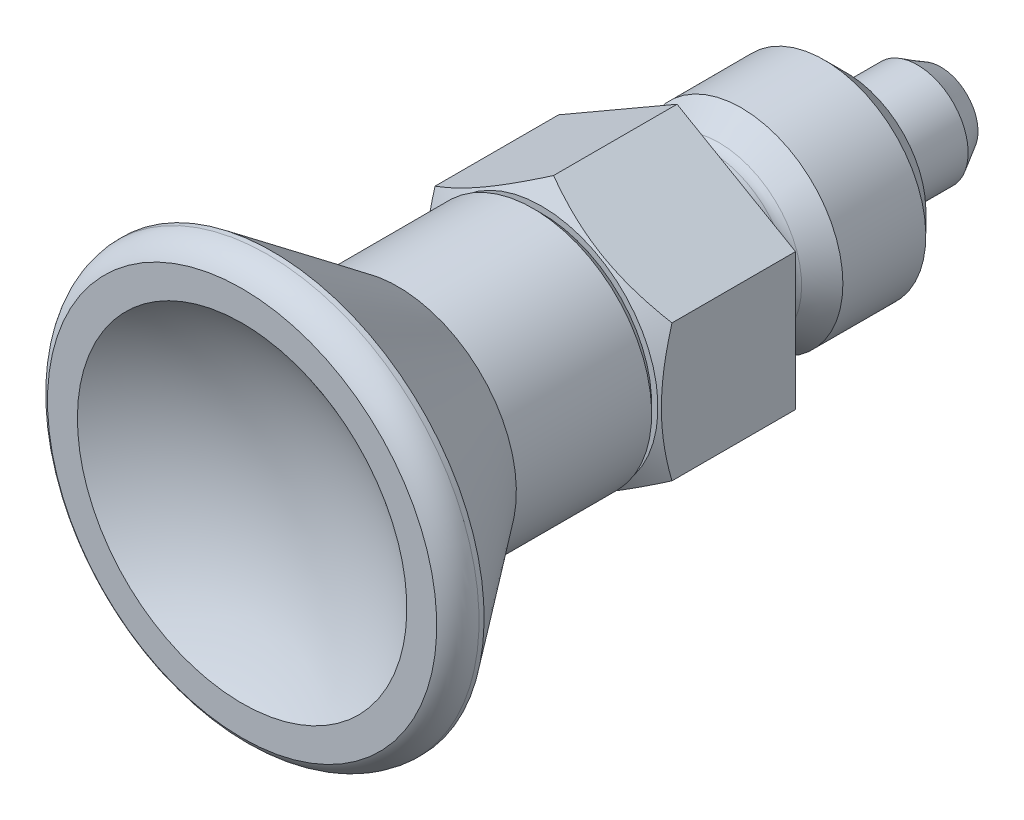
ISO-10303-21;
HEADER;
FILE_DESCRIPTION(('STEP AP214'),'2;1');
FILE_NAME('part.step','',(''),(''),'','','');
FILE_SCHEMA(('AUTOMOTIVE_DESIGN { 1 0 10303 214 1 1 1 1 }'));
ENDSEC;
DATA;
#1=APPLICATION_CONTEXT('core data for automotive mechanical design processes');
#2=APPLICATION_PROTOCOL_DEFINITION('international standard','automotive_design',2000,#1);
#3=PRODUCT_CONTEXT('',#1,'mechanical');
#4=PRODUCT('Part','Part','',(#3));
#5=PRODUCT_RELATED_PRODUCT_CATEGORY('part','',(#4));
#6=PRODUCT_DEFINITION_FORMATION('','',#4);
#7=PRODUCT_DEFINITION_CONTEXT('part definition',#1,'design');
#8=PRODUCT_DEFINITION('design','',#6,#7);
#9=PRODUCT_DEFINITION_SHAPE('','',#8);
#10=(LENGTH_UNIT() NAMED_UNIT(*) SI_UNIT(.MILLI.,.METRE.));
#11=(NAMED_UNIT(*) PLANE_ANGLE_UNIT() SI_UNIT($,.RADIAN.));
#12=(NAMED_UNIT(*) SI_UNIT($,.STERADIAN.) SOLID_ANGLE_UNIT());
#13=UNCERTAINTY_MEASURE_WITH_UNIT(LENGTH_MEASURE(1.E-05),#10,'distance_accuracy_value','');
#14=(GEOMETRIC_REPRESENTATION_CONTEXT(3) GLOBAL_UNCERTAINTY_ASSIGNED_CONTEXT((#13)) GLOBAL_UNIT_ASSIGNED_CONTEXT((#10,
#11,#12)) REPRESENTATION_CONTEXT('',''));
#15=CARTESIAN_POINT('',(0.,0.,0.));
#16=DIRECTION('',(0.,0.,1.));
#17=DIRECTION('',(1.,0.,0.));
#18=AXIS2_PLACEMENT_3D('',#15,#16,#17);
#19=CARTESIAN_POINT('',(0.,0.,-9.9999999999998));
#20=DIRECTION('',(-1.,0.,0.));
#21=DIRECTION('',(0.,1.,0.));
#22=AXIS2_PLACEMENT_3D('',#19,#20,#21);
#23=SPHERICAL_SURFACE('',#22,6.00000000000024);
#24=CARTESIAN_POINT('',(0.,0.,-15.5810746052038));
#25=DIRECTION('',(0.,0.,1.));
#26=DIRECTION('',(0.,-1.,0.));
#27=AXIS2_PLACEMENT_3D('',#24,#25,#26);
#28=CIRCLE('',#27,2.20263620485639);
#29=CARTESIAN_POINT('',(0.,-2.20263620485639,-15.5810746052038));
#30=VERTEX_POINT('',#29);
#31=EDGE_CURVE('E18',#30,#30,#28,.T.);
#32=ORIENTED_EDGE('',*,*,#31,.F.);
#33=EDGE_LOOP('',(#32));
#34=FACE_BOUND('',#33,.T.);
#35=ADVANCED_FACE('F14',(#34),#23,.T.);
#36=CARTESIAN_POINT('',(0.,0.,-14.1999999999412));
#37=DIRECTION('',(0.,0.,1.));
#38=DIRECTION('',(0.,-1.,0.));
#39=AXIS2_PLACEMENT_3D('',#36,#37,#38);
#40=CONICAL_SURFACE('',#39,2.99999999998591,0.523598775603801);
#41=CARTESIAN_POINT('',(0.,0.,-14.2));
#42=DIRECTION('',(0.,0.,1.));
#43=DIRECTION('',(0.,-1.,0.));
#44=AXIS2_PLACEMENT_3D('',#41,#42,#43);
#45=CIRCLE('',#44,3.);
#46=CARTESIAN_POINT('',(0.,-3.,-14.2));
#47=VERTEX_POINT('',#46);
#48=EDGE_CURVE('E266',#47,#47,#45,.T.);
#49=ORIENTED_EDGE('',*,*,#48,.F.);
#50=EDGE_LOOP('',(#49));
#51=FACE_BOUND('',#50,.T.);
#52=ORIENTED_EDGE('',*,*,#31,.T.);
#53=EDGE_LOOP('',(#52));
#54=FACE_BOUND('',#53,.T.);
#55=ADVANCED_FACE('F177',(#51,#54),#40,.T.);
#56=CARTESIAN_POINT('',(0.,0.,-16.));
#57=DIRECTION('',(0.,0.,1.));
#58=DIRECTION('',(0.,-1.,0.));
#59=AXIS2_PLACEMENT_3D('',#56,#57,#58);
#60=CYLINDRICAL_SURFACE('',#59,3.);
#61=CARTESIAN_POINT('',(0.,0.,-10.));
#62=DIRECTION('',(0.,0.,1.));
#63=DIRECTION('',(0.,-1.,0.));
#64=AXIS2_PLACEMENT_3D('',#61,#62,#63);
#65=CIRCLE('',#64,3.);
#66=CARTESIAN_POINT('',(0.,-3.,-10.));
#67=VERTEX_POINT('',#66);
#68=EDGE_CURVE('E269',#67,#67,#65,.F.);
#69=ORIENTED_EDGE('',*,*,#68,.T.);
#70=EDGE_LOOP('',(#69));
#71=FACE_BOUND('',#70,.T.);
#72=ORIENTED_EDGE('',*,*,#48,.T.);
#73=EDGE_LOOP('',(#72));
#74=FACE_BOUND('',#73,.T.);
#75=ADVANCED_FACE('F174',(#71,#74),#60,.T.);
#76=CARTESIAN_POINT('',(4.7,0.,-10.));
#77=DIRECTION('',(0.,0.,1.));
#78=DIRECTION('',(0.,-1.,0.));
#79=AXIS2_PLACEMENT_3D('',#76,#77,#78);
#80=PLANE('',#79);
#81=CARTESIAN_POINT('',(0.,0.,-10.0000000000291));
#82=DIRECTION('',(0.,0.,1.));
#83=DIRECTION('',(0.,-1.,0.));
#84=AXIS2_PLACEMENT_3D('',#81,#82,#83);
#85=CIRCLE('',#84,4.70000000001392);
#86=CARTESIAN_POINT('',(0.,-4.70000000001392,-10.0000000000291));
#87=VERTEX_POINT('',#86);
#88=EDGE_CURVE('E276',#87,#87,#85,.T.);
#89=ORIENTED_EDGE('',*,*,#88,.F.);
#90=EDGE_LOOP('',(#89));
#91=FACE_BOUND('',#90,.T.);
#92=ORIENTED_EDGE('',*,*,#68,.F.);
#93=EDGE_LOOP('',(#92));
#94=FACE_BOUND('',#93,.T.);
#95=ADVANCED_FACE('F170',(#91,#94),#80,.F.);
#96=CARTESIAN_POINT('',(0.,0.,-8.69999999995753));
#97=DIRECTION('',(0.,0.,1.));
#98=DIRECTION('',(0.,-1.,0.));
#99=AXIS2_PLACEMENT_3D('',#96,#97,#98);
#100=CONICAL_SURFACE('',#99,6.00000000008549,0.785398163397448);
#101=CARTESIAN_POINT('',(0.,0.,-8.7));
#102=DIRECTION('',(0.,0.,1.));
#103=DIRECTION('',(0.,-1.,0.));
#104=AXIS2_PLACEMENT_3D('',#101,#102,#103);
#105=CIRCLE('',#104,6.);
#106=CARTESIAN_POINT('',(0.,-6.,-8.7));
#107=VERTEX_POINT('',#106);
#108=EDGE_CURVE('E272',#107,#107,#105,.T.);
#109=ORIENTED_EDGE('',*,*,#108,.F.);
#110=EDGE_LOOP('',(#109));
#111=FACE_BOUND('',#110,.T.);
#112=ORIENTED_EDGE('',*,*,#88,.T.);
#113=EDGE_LOOP('',(#112));
#114=FACE_BOUND('',#113,.T.);
#115=ADVANCED_FACE('F166',(#111,#114),#100,.T.);
#116=CARTESIAN_POINT('',(0.,0.,-10.));
#117=DIRECTION('',(0.,0.,1.));
#118=DIRECTION('',(0.,-1.,0.));
#119=AXIS2_PLACEMENT_3D('',#116,#117,#118);
#120=CYLINDRICAL_SURFACE('',#119,6.);
#121=CARTESIAN_POINT('',(0.,0.,-3.80000000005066));
#122=DIRECTION('',(0.,0.,-1.));
#123=DIRECTION('',(0.,1.,0.));
#124=AXIS2_PLACEMENT_3D('',#121,#122,#123);
#125=CIRCLE('',#124,6.00000000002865);
#126=CARTESIAN_POINT('',(0.,6.00000000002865,-3.80000000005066));
#127=VERTEX_POINT('',#126);
#128=EDGE_CURVE('E275',#127,#127,#125,.F.);
#129=ORIENTED_EDGE('',*,*,#128,.F.);
#130=EDGE_LOOP('',(#129));
#131=FACE_BOUND('',#130,.T.);
#132=ORIENTED_EDGE('',*,*,#108,.T.);
#133=EDGE_LOOP('',(#132));
#134=FACE_BOUND('',#133,.T.);
#135=ADVANCED_FACE('F162',(#131,#134),#120,.T.);
#136=CARTESIAN_POINT('',(0.,0.,-3.80000000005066));
#137=DIRECTION('',(0.,0.,-1.));
#138=DIRECTION('',(0.,1.,0.));
#139=AXIS2_PLACEMENT_3D('',#136,#137,#138);
#140=CONICAL_SURFACE('',#139,6.00000000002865,0.698131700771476);
#141=CARTESIAN_POINT('',(0.,0.,-2.4737742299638));
#142=DIRECTION('',(0.,0.,-1.));
#143=DIRECTION('',(0.,1.,0.));
#144=AXIS2_PLACEMENT_3D('',#141,#142,#143);
#145=CIRCLE('',#144,4.88716444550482);
#146=CARTESIAN_POINT('',(0.,4.88716444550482,-2.4737742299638));
#147=VERTEX_POINT('',#146);
#148=EDGE_CURVE('E149',#147,#147,#145,.T.);
#149=ORIENTED_EDGE('',*,*,#148,.T.);
#150=EDGE_LOOP('',(#149));
#151=FACE_BOUND('',#150,.T.);
#152=ORIENTED_EDGE('',*,*,#128,.T.);
#153=EDGE_LOOP('',(#152));
#154=FACE_BOUND('',#153,.T.);
#155=ADVANCED_FACE('F158',(#151,#154),#140,.T.);
#156=CARTESIAN_POINT('',(0.,0.,-1.95954414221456));
#157=DIRECTION('',(0.,0.,-1.));
#158=DIRECTION('',(0.,1.,0.));
#159=AXIS2_PLACEMENT_3D('',#156,#157,#158);
#160=TOROIDAL_SURFACE('',#159,5.5,0.800000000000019);
#161=CARTESIAN_POINT('',(0.,0.,-1.95954414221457));
#162=DIRECTION('',(0.,0.,1.));
#163=DIRECTION('',(0.,-1.,0.));
#164=AXIS2_PLACEMENT_3D('',#161,#162,#163);
#165=CIRCLE('',#164,4.7);
#166=CARTESIAN_POINT('',(0.,-4.7,-1.95954414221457));
#167=VERTEX_POINT('',#166);
#168=EDGE_CURVE('E136',#167,#167,#165,.T.);
#169=ORIENTED_EDGE('',*,*,#168,.F.);
#170=EDGE_LOOP('',(#169));
#171=FACE_BOUND('',#170,.T.);
#172=ORIENTED_EDGE('',*,*,#148,.F.);
#173=EDGE_LOOP('',(#172));
#174=FACE_BOUND('',#173,.T.);
#175=ADVANCED_FACE('F155',(#171,#174),#160,.F.);
#176=CARTESIAN_POINT('',(0.,0.,-10.));
#177=DIRECTION('',(0.,0.,1.));
#178=DIRECTION('',(0.,-1.,0.));
#179=AXIS2_PLACEMENT_3D('',#176,#177,#178);
#180=CYLINDRICAL_SURFACE('',#179,4.7);
#181=CARTESIAN_POINT('',(0.,0.,-0.8));
#182=DIRECTION('',(0.,0.,-1.));
#183=DIRECTION('',(0.,1.,0.));
#184=AXIS2_PLACEMENT_3D('',#181,#182,#183);
#185=CIRCLE('',#184,4.7);
#186=CARTESIAN_POINT('',(0.,4.7,-0.8));
#187=VERTEX_POINT('',#186);
#188=EDGE_CURVE('E133',#187,#187,#185,.T.);
#189=ORIENTED_EDGE('',*,*,#188,.T.);
#190=EDGE_LOOP('',(#189));
#191=FACE_BOUND('',#190,.T.);
#192=ORIENTED_EDGE('',*,*,#168,.T.);
#193=EDGE_LOOP('',(#192));
#194=FACE_BOUND('',#193,.T.);
#195=ADVANCED_FACE('F126',(#191,#194),#180,.T.);
#196=CARTESIAN_POINT('',(0.,0.,-0.8));
#197=DIRECTION('',(0.,0.,-1.));
#198=DIRECTION('',(0.,1.,0.));
#199=AXIS2_PLACEMENT_3D('',#196,#197,#198);
#200=TOROIDAL_SURFACE('',#199,5.5,0.8);
#201=CARTESIAN_POINT('',(0.,0.,0.));
#202=DIRECTION('',(0.,0.,-1.));
#203=DIRECTION('',(0.,1.,0.));
#204=AXIS2_PLACEMENT_3D('',#201,#202,#203);
#205=CIRCLE('',#204,5.5);
#206=CARTESIAN_POINT('',(0.,5.5,0.));
#207=VERTEX_POINT('',#206);
#208=EDGE_CURVE('E81',#207,#207,#205,.T.);
#209=ORIENTED_EDGE('',*,*,#208,.T.);
#210=EDGE_LOOP('',(#209));
#211=FACE_BOUND('',#210,.T.);
#212=ORIENTED_EDGE('',*,*,#188,.F.);
#213=EDGE_LOOP('',(#212));
#214=FACE_BOUND('',#213,.T.);
#215=ADVANCED_FACE('F119',(#211,#214),#200,.F.);
#216=CARTESIAN_POINT('',(19.,0.,0.));
#217=DIRECTION('',(0.,0.,1.));
#218=DIRECTION('',(0.,-1.,0.));
#219=AXIS2_PLACEMENT_3D('',#216,#217,#218);
#220=PLANE('',#219);
#221=DIRECTION('',(-0.866025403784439,0.5,0.));
#222=VECTOR('',#221,1.);
#223=CARTESIAN_POINT('',(7.,4.04145188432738,0.));
#224=LINE('',#223,#222);
#225=CARTESIAN_POINT('',(7.,4.04145188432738,0.));
#226=VERTEX_POINT('',#225);
#227=CARTESIAN_POINT('',(0.,8.08290376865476,0.));
#228=VERTEX_POINT('',#227);
#229=EDGE_CURVE('E88',#226,#228,#224,.T.);
#230=ORIENTED_EDGE('',*,*,#229,.F.);
#231=DIRECTION('',(0.,1.,0.));
#232=VECTOR('',#231,1.);
#233=CARTESIAN_POINT('',(7.,-4.04145188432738,0.));
#234=LINE('',#233,#232);
#235=CARTESIAN_POINT('',(7.,-4.04145188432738,0.));
#236=VERTEX_POINT('',#235);
#237=EDGE_CURVE('E84',#236,#226,#234,.T.);
#238=ORIENTED_EDGE('',*,*,#237,.F.);
#239=DIRECTION('',(0.866025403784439,0.5,0.));
#240=VECTOR('',#239,1.);
#241=CARTESIAN_POINT('',(0.,-8.08290376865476,0.));
#242=LINE('',#241,#240);
#243=CARTESIAN_POINT('',(0.,-8.08290376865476,0.));
#244=VERTEX_POINT('',#243);
#245=EDGE_CURVE('E60',#244,#236,#242,.T.);
#246=ORIENTED_EDGE('',*,*,#245,.F.);
#247=DIRECTION('',(0.866025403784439,-0.5,0.));
#248=VECTOR('',#247,1.);
#249=CARTESIAN_POINT('',(-7.,-4.04145188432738,0.));
#250=LINE('',#249,#248);
#251=CARTESIAN_POINT('',(-7.,-4.04145188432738,0.));
#252=VERTEX_POINT('',#251);
#253=EDGE_CURVE('E100',#252,#244,#250,.T.);
#254=ORIENTED_EDGE('',*,*,#253,.F.);
#255=DIRECTION('',(0.,-1.,0.));
#256=VECTOR('',#255,1.);
#257=CARTESIAN_POINT('',(-7.,4.04145188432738,0.));
#258=LINE('',#257,#256);
#259=CARTESIAN_POINT('',(-7.,4.04145188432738,0.));
#260=VERTEX_POINT('',#259);
#261=EDGE_CURVE('E65',#260,#252,#258,.T.);
#262=ORIENTED_EDGE('',*,*,#261,.F.);
#263=DIRECTION('',(-0.866025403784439,-0.5,0.));
#264=VECTOR('',#263,1.);
#265=CARTESIAN_POINT('',(0.,8.08290376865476,0.));
#266=LINE('',#265,#264);
#267=EDGE_CURVE('E353',#228,#260,#266,.T.);
#268=ORIENTED_EDGE('',*,*,#267,.F.);
#269=EDGE_LOOP('',(#230,#238,#246,#254,#262,#268));
#270=FACE_BOUND('',#269,.T.);
#271=ORIENTED_EDGE('',*,*,#208,.F.);
#272=EDGE_LOOP('',(#271));
#273=FACE_BOUND('',#272,.T.);
#274=ADVANCED_FACE('F85',(#270,#273),#220,.F.);
#275=CARTESIAN_POINT('',(0.,-8.08290376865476,0.));
#276=DIRECTION('',(0.5,-0.866025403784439,0.));
#277=DIRECTION('',(0.866025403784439,0.5,0.));
#278=AXIS2_PLACEMENT_3D('',#275,#276,#277);
#279=PLANE('',#278);
#280=ORIENTED_EDGE('',*,*,#245,.T.);
#281=DIRECTION('',(0.,0.,1.));
#282=VECTOR('',#281,1.);
#283=CARTESIAN_POINT('',(7.,-4.04145188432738,0.));
#284=LINE('',#283,#282);
#285=CARTESIAN_POINT('',(7.,-4.04145190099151,7.29999999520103));
#286=VERTEX_POINT('',#285);
#287=EDGE_CURVE('E77',#286,#236,#284,.F.);
#288=ORIENTED_EDGE('',*,*,#287,.F.);
#289=CARTESIAN_POINT('',(7.50150873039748E-08,-8.08290372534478,7.30000002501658));
#290=CARTESIAN_POINT('',(0.153866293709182,-7.99406902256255,7.35127886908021));
#291=CARTESIAN_POINT('',(0.308306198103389,-7.90490310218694,7.40023029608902));
#292=CARTESIAN_POINT('',(0.618440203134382,-7.72584715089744,7.49283732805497));
#293=CARTESIAN_POINT('',(0.774134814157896,-7.63595682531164,7.53649064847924));
#294=CARTESIAN_POINT('',(1.24371133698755,-7.36484669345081,7.65864652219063));
#295=CARTESIAN_POINT('',(1.55944676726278,-7.1825567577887,7.72812629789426));
#296=CARTESIAN_POINT('',(2.03193905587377,-6.90976320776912,7.80959757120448));
#297=CARTESIAN_POINT('',(2.18728429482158,-6.82007459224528,7.83280599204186));
#298=CARTESIAN_POINT('',(2.49867659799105,-6.64029216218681,7.87172219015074));
#299=CARTESIAN_POINT('',(2.65472359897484,-6.55019838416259,7.8874306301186));
#300=CARTESIAN_POINT('',(2.96708853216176,-6.36985440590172,7.91094653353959));
#301=CARTESIAN_POINT('',(3.12340595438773,-6.27960450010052,7.91876296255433));
#302=CARTESIAN_POINT('',(3.43617645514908,-6.09902636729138,7.92633563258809));
#303=CARTESIAN_POINT('',(3.59262952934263,-6.00869814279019,7.92609212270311));
#304=CARTESIAN_POINT('',(4.0212330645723,-5.76124377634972,7.91434695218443));
#305=CARTESIAN_POINT('',(4.29324314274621,-5.60419868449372,7.89463983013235));
#306=CARTESIAN_POINT('',(4.83545668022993,-5.29115155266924,7.83215511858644));
#307=CARTESIAN_POINT('',(5.10565823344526,-5.13515061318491,7.78935618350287));
#308=CARTESIAN_POINT('',(5.64896247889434,-4.82147376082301,7.68237391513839));
#309=CARTESIAN_POINT('',(5.92199663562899,-4.66383741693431,7.61773742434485));
#310=CARTESIAN_POINT('',(6.4639938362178,-4.35091518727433,7.47103968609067));
#311=CARTESIAN_POINT('',(6.73296381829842,-4.19562529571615,7.38901288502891));
#312=CARTESIAN_POINT('',(6.99999992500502,-4.04145192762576,7.30000002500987));
#313=B_SPLINE_CURVE_WITH_KNOTS('',3,(#289,#290,#291,#292,#293,#294,#295,#296,#297,#298,#299,
#300,#301,#302,#303,#304,#305,#306,#307,#308,#309,#310,#311,#312),.UNSPECIFIED.,.F.,.F.,(4,2,2,
2,2,2,2,2,2,2,2,4),(0.,0.554720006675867,1.10967836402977,2.22190067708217,2.7643911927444,
3.30683376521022,3.848659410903,4.39046831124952,5.33360240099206,6.27760980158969,
7.24255076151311,8.2055979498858),.UNSPECIFIED.);
#314=CARTESIAN_POINT('',(3.75075449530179E-08,-8.08290374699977,7.30000001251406));
#315=VERTEX_POINT('',#314);
#316=EDGE_CURVE('E52',#315,#286,#313,.T.);
#317=ORIENTED_EDGE('',*,*,#316,.F.);
#318=DIRECTION('',(0.,0.,1.));
#319=VECTOR('',#318,1.);
#320=CARTESIAN_POINT('',(0.,-8.08290376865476,0.));
#321=LINE('',#320,#319);
#322=EDGE_CURVE('E79',#244,#315,#321,.T.);
#323=ORIENTED_EDGE('',*,*,#322,.F.);
#324=EDGE_LOOP('',(#280,#288,#317,#323));
#325=FACE_BOUND('',#324,.T.);
#326=ADVANCED_FACE('F75',(#325),#279,.T.);
#327=CARTESIAN_POINT('',(7.,-4.04145188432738,0.));
#328=DIRECTION('',(1.,0.,0.));
#329=DIRECTION('',(0.,1.,0.));
#330=AXIS2_PLACEMENT_3D('',#327,#328,#329);
#331=PLANE('',#330);
#332=ORIENTED_EDGE('',*,*,#237,.T.);
#333=DIRECTION('',(0.,0.,1.));
#334=VECTOR('',#333,1.);
#335=CARTESIAN_POINT('',(7.,4.04145188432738,0.));
#336=LINE('',#335,#334);
#337=CARTESIAN_POINT('',(7.00000001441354,4.04145187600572,7.29999999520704));
#338=VERTEX_POINT('',#337);
#339=EDGE_CURVE('E91',#338,#226,#336,.F.);
#340=ORIENTED_EDGE('',*,*,#339,.F.);
#341=CARTESIAN_POINT('',(7.,-4.04145191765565,7.29999999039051));
#342=CARTESIAN_POINT('',(7.,-3.86378251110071,7.35127883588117));
#343=CARTESIAN_POINT('',(7.,-3.68545066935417,7.40023026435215));
#344=CARTESIAN_POINT('',(7.,-3.32733876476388,7.49283729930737));
#345=CARTESIAN_POINT('',(7.,-3.1475581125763,7.53649062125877));
#346=CARTESIAN_POINT('',(7.,-2.60533784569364,7.65864649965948));
#347=CARTESIAN_POINT('',(7.,-2.24075797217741,7.72812627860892));
#348=CARTESIAN_POINT('',(7.,-1.69517086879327,7.80959755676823));
#349=CARTESIAN_POINT('',(7.,-1.51579363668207,7.83280597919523));
#350=CARTESIAN_POINT('',(7.,-1.15622877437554,7.87172218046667));
#351=CARTESIAN_POINT('',(7.,-0.976041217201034,7.88743062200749));
#352=CARTESIAN_POINT('',(7.,-0.615353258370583,7.91094652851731));
#353=CARTESIAN_POINT('',(7.,-0.434853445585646,7.91876295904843));
#354=CARTESIAN_POINT('',(7.,-0.0736971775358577,7.92633563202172));
#355=CARTESIAN_POINT('',(7.,0.106959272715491,7.92609212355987));
#356=CARTESIAN_POINT('',(7.,0.601868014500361,7.91434695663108));
#357=CARTESIAN_POINT('',(7.,0.915958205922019,7.89463983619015));
#358=CARTESIAN_POINT('',(7.,1.54205248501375,7.83215512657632));
#359=CARTESIAN_POINT('',(7.,1.85405437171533,7.78935619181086));
#360=CARTESIAN_POINT('',(7.,2.48140809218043,7.68237392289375));
#361=CARTESIAN_POINT('',(7.,2.79668078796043,7.6177374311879));
#362=CARTESIAN_POINT('',(7.,3.42252526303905,7.47103969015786));
#363=CARTESIAN_POINT('',(7.,3.73310505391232,7.38901288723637));
#364=CARTESIAN_POINT('',(7.,4.04145179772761,7.30000002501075));
#365=B_SPLINE_CURVE_WITH_KNOTS('',3,(#341,#342,#343,#344,#345,#346,#347,#348,#349,#350,#351,
#352,#353,#354,#355,#356,#357,#358,#359,#360,#361,#362,#363,#364),.UNSPECIFIED.,.F.,.F.,(4,2,2,
2,2,2,2,2,2,2,2,4),(0.,0.554720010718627,1.10967837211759,2.22190069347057,2.76439121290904,
3.3068337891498,3.84865943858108,4.39046834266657,5.33360245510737,6.27760987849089,
7.24255086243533,8.20559807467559),.UNSPECIFIED.);
#366=EDGE_CURVE('E95',#286,#338,#365,.T.);
#367=ORIENTED_EDGE('',*,*,#366,.F.);
#368=ORIENTED_EDGE('',*,*,#287,.T.);
#369=EDGE_LOOP('',(#332,#340,#367,#368));
#370=FACE_BOUND('',#369,.T.);
#371=ADVANCED_FACE('F93',(#370),#331,.T.);
#372=CARTESIAN_POINT('',(7.,4.04145188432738,0.));
#373=DIRECTION('',(0.5,0.866025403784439,0.));
#374=DIRECTION('',(-0.866025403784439,0.5,0.));
#375=AXIS2_PLACEMENT_3D('',#372,#373,#374);
#376=PLANE('',#375);
#377=ORIENTED_EDGE('',*,*,#229,.T.);
#378=DIRECTION('',(0.,0.,1.));
#379=VECTOR('',#378,1.);
#380=CARTESIAN_POINT('',(0.,8.08290376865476,0.));
#381=LINE('',#380,#379);
#382=CARTESIAN_POINT('',(-1.1533189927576E-08,8.08290376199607,7.30000000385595));
#383=VERTEX_POINT('',#382);
#384=EDGE_CURVE('E358',#383,#228,#381,.F.);
#385=ORIENTED_EDGE('',*,*,#384,.F.);
#386=CARTESIAN_POINT('',(7.00000002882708,4.04145186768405,7.29999999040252));
#387=CARTESIAN_POINT('',(6.84613380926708,4.13028657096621,7.35127883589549));
#388=CARTESIAN_POINT('',(6.69169390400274,4.2194524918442,7.40023026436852));
#389=CARTESIAN_POINT('',(6.38155989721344,4.39850844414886,7.49283729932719));
#390=CARTESIAN_POINT('',(6.22586528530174,4.48839877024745,7.53649062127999));
#391=CARTESIAN_POINT('',(5.7562887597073,4.75950890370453,7.65864649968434));
#392=CARTESIAN_POINT('',(5.44055332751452,4.94179884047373,7.72812627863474));
#393=CARTESIAN_POINT('',(4.96806103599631,5.2145923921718,7.80959755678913));
#394=CARTESIAN_POINT('',(4.81271579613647,5.3042810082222,7.83280597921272));
#395=CARTESIAN_POINT('',(4.50132349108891,5.48406343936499,7.87172218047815));
#396=CARTESIAN_POINT('',(4.34527648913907,5.57415721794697,7.88743062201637));
#397=CARTESIAN_POINT('',(4.03291155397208,5.75450119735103,7.91094652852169));
#398=CARTESIAN_POINT('',(3.87659413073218,5.84475110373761,7.91876295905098));
#399=CARTESIAN_POINT('',(3.56382362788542,6.02532923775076,7.92633563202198));
#400=CARTESIAN_POINT('',(3.40737055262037,6.11565746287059,7.92609212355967));
#401=CARTESIAN_POINT('',(2.97876700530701,6.36311183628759,7.91434695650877));
#402=CARTESIAN_POINT('',(2.70675691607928,6.52015693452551,7.89463983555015));
#403=CARTESIAN_POINT('',(2.16454335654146,6.83320407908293,7.83215512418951));
#404=CARTESIAN_POINT('',(1.89434179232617,6.98920502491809,7.78935618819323));
#405=CARTESIAN_POINT('',(1.35103752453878,7.30288189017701,7.68237391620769));
#406=CARTESIAN_POINT('',(1.07800335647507,7.46051824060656,7.61773742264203));
#407=CARTESIAN_POINT('',(0.536006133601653,7.77344048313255,7.47103967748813));
#408=CARTESIAN_POINT('',(0.267036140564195,7.92873038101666,7.38901287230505));
#409=CARTESIAN_POINT('',(2.30663772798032E-08,8.08290375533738,7.30000000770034));
#410=B_SPLINE_CURVE_WITH_KNOTS('',3,(#386,#387,#388,#389,#390,#391,#392,#393,#394,#395,#396,
#397,#398,#399,#400,#401,#402,#403,#404,#405,#406,#407,#408,#409),.UNSPECIFIED.,.F.,.F.,(4,2,2,
2,2,2,2,2,2,2,2,4),(0.,0.554720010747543,1.10967837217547,2.22190069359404,2.76439121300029,
3.30683378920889,3.84865943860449,4.39046834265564,5.33360247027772,6.27760990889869,
7.24255090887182,8.20559813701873),.UNSPECIFIED.);
#411=EDGE_CURVE('E304',#338,#383,#410,.T.);
#412=ORIENTED_EDGE('',*,*,#411,.F.);
#413=ORIENTED_EDGE('',*,*,#339,.T.);
#414=EDGE_LOOP('',(#377,#385,#412,#413));
#415=FACE_BOUND('',#414,.T.);
#416=ADVANCED_FACE('F313',(#415),#376,.T.);
#417=CARTESIAN_POINT('',(0.,8.08290376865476,0.));
#418=DIRECTION('',(-0.5,0.866025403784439,0.));
#419=DIRECTION('',(-0.866025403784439,-0.5,0.));
#420=AXIS2_PLACEMENT_3D('',#417,#418,#419);
#421=PLANE('',#420);
#422=ORIENTED_EDGE('',*,*,#267,.T.);
#423=DIRECTION('',(0.,0.,1.));
#424=VECTOR('',#423,1.);
#425=CARTESIAN_POINT('',(-7.,4.04145188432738,0.));
#426=LINE('',#425,#424);
#427=CARTESIAN_POINT('',(-7.,4.04145190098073,7.29999999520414));
#428=VERTEX_POINT('',#427);
#429=EDGE_CURVE('E355',#428,#260,#426,.F.);
#430=ORIENTED_EDGE('',*,*,#429,.F.);
#431=CARTESIAN_POINT('',(-2.30663798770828E-08,8.08290375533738,7.30000000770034));
#432=CARTESIAN_POINT('',(-0.153866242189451,7.99406905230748,7.35127885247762));
#433=CARTESIAN_POINT('',(-0.308306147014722,7.90490313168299,7.40023028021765));
#434=CARTESIAN_POINT('',(-0.618440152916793,7.72584717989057,7.49283731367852));
#435=CARTESIAN_POINT('',(-0.774134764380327,7.63595685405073,7.53649063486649));
#436=CARTESIAN_POINT('',(-1.243711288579,7.3648467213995,7.65864651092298));
#437=CARTESIAN_POINT('',(-1.55944671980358,7.18255678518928,7.72812628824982));
#438=CARTESIAN_POINT('',(-2.03193900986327,6.9097632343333,7.80959756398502));
#439=CARTESIAN_POINT('',(-2.18728424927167,6.82007461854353,7.83280598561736));
#440=CARTESIAN_POINT('',(-2.49867655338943,6.64029218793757,7.87172218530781));
#441=CARTESIAN_POINT('',(-2.6547235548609,6.55019840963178,7.8874306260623));
#442=CARTESIAN_POINT('',(-2.9670884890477,6.36985443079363,7.91094653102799));
#443=CARTESIAN_POINT('',(-3.12340591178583,6.27960452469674,7.91876296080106));
#444=CARTESIAN_POINT('',(-3.43617641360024,6.09902639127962,7.92633563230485));
#445=CARTESIAN_POINT('',(-3.59262948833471,6.00869816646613,7.92609212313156));
#446=CARTESIAN_POINT('',(-4.02123302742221,5.76124379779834,7.91434695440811));
#447=CARTESIAN_POINT('',(-4.29324310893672,5.60419870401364,7.89463983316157));
#448=CARTESIAN_POINT('',(-4.83545665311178,5.29115156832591,7.83215512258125));
#449=CARTESIAN_POINT('',(-5.10565820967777,5.13515062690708,7.78935618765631));
#450=CARTESIAN_POINT('',(-5.6489624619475,4.82147377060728,7.68237391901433));
#451=CARTESIAN_POINT('',(-5.92199662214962,4.66383742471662,7.61773742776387));
#452=CARTESIAN_POINT('',(-6.46399382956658,4.35091519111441,7.47103968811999));
#453=CARTESIAN_POINT('',(-6.73296381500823,4.19562529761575,7.38901288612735));
#454=CARTESIAN_POINT('',(-6.9999999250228,4.04145192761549,7.30000002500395));
#455=B_SPLINE_CURVE_WITH_KNOTS('',3,(#431,#432,#433,#434,#435,#436,#437,#438,#439,#440,#441,
#442,#443,#444,#445,#446,#447,#448,#449,#450,#451,#452,#453,#454),.UNSPECIFIED.,.F.,.F.,(4,2,2,
2,2,2,2,2,2,2,2,4),(0.,0.554720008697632,1.10967836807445,2.22190068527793,2.76439120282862,
3.30683377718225,3.84865942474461,4.39046832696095,5.3336024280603,6.27760984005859,
7.24255081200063,8.20559801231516),.UNSPECIFIED.);
#456=EDGE_CURVE('E325',#383,#428,#455,.T.);
#457=ORIENTED_EDGE('',*,*,#456,.F.);
#458=ORIENTED_EDGE('',*,*,#384,.T.);
#459=EDGE_LOOP('',(#422,#430,#457,#458));
#460=FACE_BOUND('',#459,.T.);
#461=ADVANCED_FACE('F317',(#460),#421,.T.);
#462=CARTESIAN_POINT('',(-7.,4.04145188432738,0.));
#463=DIRECTION('',(-1.,0.,0.));
#464=DIRECTION('',(0.,-1.,0.));
#465=AXIS2_PLACEMENT_3D('',#462,#463,#464);
#466=PLANE('',#465);
#467=ORIENTED_EDGE('',*,*,#261,.T.);
#468=DIRECTION('',(0.,0.,1.));
#469=VECTOR('',#468,1.);
#470=CARTESIAN_POINT('',(-7.,-4.04145188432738,0.));
#471=LINE('',#470,#469);
#472=CARTESIAN_POINT('',(-7.00000001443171,-4.04145187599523,7.29999999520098));
#473=VERTEX_POINT('',#472);
#474=EDGE_CURVE('E33',#473,#252,#471,.F.);
#475=ORIENTED_EDGE('',*,*,#474,.F.);
#476=CARTESIAN_POINT('',(-7.,4.04145191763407,7.29999999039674));
#477=CARTESIAN_POINT('',(-7.,3.8637825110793,7.35127883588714));
#478=CARTESIAN_POINT('',(-7.,3.68545066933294,7.40023026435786));
#479=CARTESIAN_POINT('',(-7.,3.32733876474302,7.49283729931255));
#480=CARTESIAN_POINT('',(-7.,3.14755811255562,7.53649062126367));
#481=CARTESIAN_POINT('',(-7.,2.60533784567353,7.65864649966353));
#482=CARTESIAN_POINT('',(-7.,2.24075797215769,7.72812627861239));
#483=CARTESIAN_POINT('',(-7.,1.69517086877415,7.80959755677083));
#484=CARTESIAN_POINT('',(-7.,1.51579363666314,7.83280597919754));
#485=CARTESIAN_POINT('',(-7.,1.15622877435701,7.87172218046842));
#486=CARTESIAN_POINT('',(-7.,0.976041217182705,7.88743062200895));
#487=CARTESIAN_POINT('',(-7.,0.61535325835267,7.91094652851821));
#488=CARTESIAN_POINT('',(-7.,0.434853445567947,7.91876295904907));
#489=CARTESIAN_POINT('',(-7.,0.0736971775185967,7.92633563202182));
#490=CARTESIAN_POINT('',(-7.,-0.106959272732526,7.92609212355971));
#491=CARTESIAN_POINT('',(-7.,-0.601868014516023,7.91434695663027));
#492=CARTESIAN_POINT('',(-7.,-0.915958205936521,7.89463983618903));
#493=CARTESIAN_POINT('',(-7.,-1.54205248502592,7.83215512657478));
#494=CARTESIAN_POINT('',(-7.,-1.85405437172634,7.7893561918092));
#495=CARTESIAN_POINT('',(-7.,-2.48140809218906,7.68237392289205));
#496=CARTESIAN_POINT('',(-7.,-2.79668078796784,7.61773743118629));
#497=CARTESIAN_POINT('',(-7.,-3.42252526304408,7.47103969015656));
#498=CARTESIAN_POINT('',(-7.,-3.73310505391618,7.3890128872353));
#499=CARTESIAN_POINT('',(-7.,-4.04145179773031,7.30000002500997));
#500=B_SPLINE_CURVE_WITH_KNOTS('',3,(#476,#477,#478,#479,#480,#481,#482,#483,#484,#485,#486,
#487,#488,#489,#490,#491,#492,#493,#494,#495,#496,#497,#498,#499),.UNSPECIFIED.,.F.,.F.,(4,2,2,
2,2,2,2,2,2,2,2,4),(0.,0.554720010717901,1.10967837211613,2.22190069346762,2.76439121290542,
3.30683378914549,3.8486594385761,4.39046834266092,5.33360245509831,6.27760987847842,
7.24255086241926,8.20559807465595),.UNSPECIFIED.);
#501=EDGE_CURVE('E332',#428,#473,#500,.T.);
#502=ORIENTED_EDGE('',*,*,#501,.F.);
#503=ORIENTED_EDGE('',*,*,#429,.T.);
#504=EDGE_LOOP('',(#467,#475,#502,#503));
#505=FACE_BOUND('',#504,.T.);
#506=ADVANCED_FACE('F322',(#505),#466,.T.);
#507=CARTESIAN_POINT('',(-7.,-4.04145188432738,0.));
#508=DIRECTION('',(-0.5,-0.866025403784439,0.));
#509=DIRECTION('',(0.866025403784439,-0.5,0.));
#510=AXIS2_PLACEMENT_3D('',#507,#508,#509);
#511=PLANE('',#510);
#512=ORIENTED_EDGE('',*,*,#253,.T.);
#513=ORIENTED_EDGE('',*,*,#322,.T.);
#514=CARTESIAN_POINT('',(-7.00000002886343,-4.04145186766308,7.29999999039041));
#515=CARTESIAN_POINT('',(-6.84613380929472,-4.13028657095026,7.35127883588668));
#516=CARTESIAN_POINT('',(-6.6916939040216,-4.21945249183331,7.40023026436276));
#517=CARTESIAN_POINT('',(-6.38155989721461,-4.39850844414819,7.49283729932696));
#518=CARTESIAN_POINT('',(-6.22586528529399,-4.48839877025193,7.53649062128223));
#519=CARTESIAN_POINT('',(-5.75628875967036,-4.75950890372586,7.6586464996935));
#520=CARTESIAN_POINT('',(-5.44055332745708,-4.9417988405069,7.7281262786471));
#521=CARTESIAN_POINT('',(-4.96806103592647,-5.21459239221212,7.80959755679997));
#522=CARTESIAN_POINT('',(-4.81271579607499,-5.3042810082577,7.83280597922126));
#523=CARTESIAN_POINT('',(-4.50132349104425,-5.48406343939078,7.87172218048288));
#524=CARTESIAN_POINT('',(-4.34527648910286,-5.57415721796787,7.88743062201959));
#525=CARTESIAN_POINT('',(-4.03291155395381,-5.75450119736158,7.91094652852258));
#526=CARTESIAN_POINT('',(-3.87659413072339,-5.84475110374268,7.91876295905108));
#527=CARTESIAN_POINT('',(-3.56382362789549,-6.02532923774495,7.92633563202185));
#528=CARTESIAN_POINT('',(-3.40737055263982,-6.11565746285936,7.92609212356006));
#529=CARTESIAN_POINT('',(-2.97876700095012,-6.36311183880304,7.9143469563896));
#530=CARTESIAN_POINT('',(-2.70675690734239,-6.52015693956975,7.89463983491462));
#531=CARTESIAN_POINT('',(-2.16454333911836,-6.83320408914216,7.83215512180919));
#532=CARTESIAN_POINT('',(-1.89434177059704,-6.98920503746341,7.7893561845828));
#533=CARTESIAN_POINT('',(-1.35103749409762,-7.30288190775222,7.68237390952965));
#534=CARTESIAN_POINT('',(-1.07800332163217,-7.46051826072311,7.61773741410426));
#535=CARTESIAN_POINT('',(-0.536006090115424,-7.77344050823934,7.47103966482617));
#536=CARTESIAN_POINT('',(-0.267036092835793,-7.92873040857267,7.3890128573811));
#537=CARTESIAN_POINT('',(2.88445675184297E-08,-8.08290378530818,7.29999999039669));
#538=B_SPLINE_CURVE_WITH_KNOTS('',3,(#514,#515,#516,#517,#518,#519,#520,#521,#522,#523,#524,
#525,#526,#527,#528,#529,#530,#531,#532,#533,#534,#535,#536,#537),.UNSPECIFIED.,.F.,.F.,(4,2,2,
2,2,2,2,2,2,2,2,4),(0.,0.554720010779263,1.10967837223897,2.22190069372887,2.76439121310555,
3.30683378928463,3.84865943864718,4.3904683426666,5.33360248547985,6.27760993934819,
7.24255095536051,8.20559819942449),.UNSPECIFIED.);
#539=EDGE_CURVE('E338',#473,#315,#538,.T.);
#540=ORIENTED_EDGE('',*,*,#539,.F.);
#541=ORIENTED_EDGE('',*,*,#474,.T.);
#542=EDGE_LOOP('',(#512,#513,#540,#541));
#543=FACE_BOUND('',#542,.T.);
#544=ADVANCED_FACE('F344',(#543),#511,.T.);
#545=CARTESIAN_POINT('',(0.,0.,7.29580000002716));
#546=DIRECTION('',(0.,0.,-1.));
#547=DIRECTION('',(0.,1.,0.));
#548=AXIS2_PLACEMENT_3D('',#545,#546,#547);
#549=CONICAL_SURFACE('',#548,8.09017838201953,1.04719755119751);
#550=CARTESIAN_POINT('',(0.,0.,8.));
#551=DIRECTION('',(0.,0.,-1.));
#552=DIRECTION('',(0.,1.,0.));
#553=AXIS2_PLACEMENT_3D('',#550,#551,#552);
#554=CIRCLE('',#553,6.870468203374);
#555=CARTESIAN_POINT('',(0.,6.870468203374,8.));
#556=VERTEX_POINT('',#555);
#557=EDGE_CURVE('E239',#556,#556,#554,.T.);
#558=ORIENTED_EDGE('',*,*,#557,.T.);
#559=EDGE_LOOP('',(#558));
#560=FACE_BOUND('',#559,.T.);
#561=ORIENTED_EDGE('',*,*,#501,.T.);
#562=ORIENTED_EDGE('',*,*,#539,.T.);
#563=ORIENTED_EDGE('',*,*,#316,.T.);
#564=ORIENTED_EDGE('',*,*,#366,.T.);
#565=ORIENTED_EDGE('',*,*,#411,.T.);
#566=ORIENTED_EDGE('',*,*,#456,.T.);
#567=EDGE_LOOP('',(#561,#562,#563,#564,#565,#566));
#568=FACE_BOUND('',#567,.T.);
#569=ADVANCED_FACE('F226',(#560,#568),#549,.T.);
#570=CARTESIAN_POINT('',(0.,0.,38.4));
#571=DIRECTION('',(-1.,0.,0.));
#572=DIRECTION('',(0.,1.,0.));
#573=AXIS2_PLACEMENT_3D('',#570,#571,#572);
#574=SPHERICAL_SURFACE('',#573,16.);
#575=CARTESIAN_POINT('',(0.,9.73190628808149,25.7));
#576=CARTESIAN_POINT('',(-0.273421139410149,9.73190824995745,25.7));
#577=CARTESIAN_POINT('',(-0.54681008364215,9.72037876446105,25.7));
#578=CARTESIAN_POINT('',(-1.091736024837,9.67434130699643,25.7));
#579=CARTESIAN_POINT('',(-1.36327251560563,9.63982728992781,25.7));
#580=CARTESIAN_POINT('',(-1.90275798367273,9.54800856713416,25.7));
#581=CARTESIAN_POINT('',(-2.17070282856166,9.49067960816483,25.7));
#582=CARTESIAN_POINT('',(-2.70081243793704,9.35363887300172,25.7));
#583=CARTESIAN_POINT('',(-2.96297710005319,9.27392670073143,25.7));
#584=CARTESIAN_POINT('',(-3.4795258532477,9.09273210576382,25.7));
#585=CARTESIAN_POINT('',(-3.7339137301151,8.99126047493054,25.7));
#586=CARTESIAN_POINT('',(-4.23323988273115,8.76724349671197,25.7));
#587=CARTESIAN_POINT('',(-4.4781780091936,8.64469781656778,25.7));
#588=CARTESIAN_POINT('',(-4.95679945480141,8.37943799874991,25.7));
#589=CARTESIAN_POINT('',(-5.19048552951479,8.23672883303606,25.7));
#590=CARTESIAN_POINT('',(-5.64500156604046,7.93213690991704,25.7));
#591=CARTESIAN_POINT('',(-5.86583180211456,7.77025456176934,25.7));
#592=CARTESIAN_POINT('',(-6.29309658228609,7.42844474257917,25.7));
#593=CARTESIAN_POINT('',(-6.49952946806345,7.24851519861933,25.7));
#594=CARTESIAN_POINT('',(-6.89650428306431,6.87190546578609,25.7));
#595=CARTESIAN_POINT('',(-7.0870461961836,6.67522525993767,25.7));
#596=CARTESIAN_POINT('',(-7.45089134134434,6.26650461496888,25.7));
#597=CARTESIAN_POINT('',(-7.62419390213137,6.05446357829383,25.7));
#598=CARTESIAN_POINT('',(-7.95231974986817,5.61653562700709,25.7));
#599=CARTESIAN_POINT('',(-8.10714304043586,5.39064871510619,25.7));
#600=CARTESIAN_POINT('',(-8.39720695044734,4.92663927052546,25.7));
#601=CARTESIAN_POINT('',(-8.53244793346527,4.68851696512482,25.7));
#602=CARTESIAN_POINT('',(-8.78238916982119,4.2017257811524,25.7));
#603=CARTESIAN_POINT('',(-8.89708942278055,3.95305690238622,25.7));
#604=CARTESIAN_POINT('',(-9.1051335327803,3.44694097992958,25.7));
#605=CARTESIAN_POINT('',(-9.19847743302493,3.18949395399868,25.7));
#606=CARTESIAN_POINT('',(-9.36314551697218,2.6676515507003,25.7));
#607=CARTESIAN_POINT('',(-9.43446970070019,2.40325617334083,25.7));
#608=CARTESIAN_POINT('',(-9.55459139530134,1.86939624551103,25.7));
#609=CARTESIAN_POINT('',(-9.60338886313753,1.59993168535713,25.7));
#610=CARTESIAN_POINT('',(-9.67811000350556,1.05784961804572,25.7));
#611=CARTESIAN_POINT('',(-9.70403367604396,0.785232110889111,25.7));
#612=CARTESIAN_POINT('',(-9.73282289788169,0.238782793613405,25.7));
#613=CARTESIAN_POINT('',(-9.73568848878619,-0.0350490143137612,25.7));
#614=CARTESIAN_POINT('',(-9.7183412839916,-0.581980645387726,25.7));
#615=CARTESIAN_POINT('',(-9.69812848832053,-0.855080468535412,25.7));
#616=CARTESIAN_POINT('',(-9.63476819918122,-1.39860665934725,25.7));
#617=CARTESIAN_POINT('',(-9.59162069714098,-1.66903302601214,25.7));
#618=CARTESIAN_POINT('',(-9.48269774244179,-2.20528963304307,25.7));
#619=CARTESIAN_POINT('',(-9.41692228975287,-2.47111987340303,25.7));
#620=CARTESIAN_POINT('',(-9.26321097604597,-2.99629461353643,25.7));
#621=CARTESIAN_POINT('',(-9.17527509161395,-3.25563910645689,25.7));
#622=CARTESIAN_POINT('',(-8.97786812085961,-3.76599827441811,25.7));
#623=CARTESIAN_POINT('',(-8.86839703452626,-4.0170129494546,25.7));
#624=CARTESIAN_POINT('',(-8.62869797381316,-4.5089278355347,25.7));
#625=CARTESIAN_POINT('',(-8.49847000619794,-4.74982804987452,25.7));
#626=CARTESIAN_POINT('',(-8.21818300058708,-5.21980144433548,25.7));
#627=CARTESIAN_POINT('',(-8.06812396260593,-5.44887462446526,25.7));
#628=CARTESIAN_POINT('',(-7.74924171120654,-5.8935652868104,25.7));
#629=CARTESIAN_POINT('',(-7.58041850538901,-6.10918277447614,25.7));
#630=CARTESIAN_POINT('',(-7.22520810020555,-6.52542924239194,25.7));
#631=CARTESIAN_POINT('',(-7.03882090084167,-6.72605822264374,25.7));
#632=CARTESIAN_POINT('',(-6.64980758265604,-7.11090135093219,25.7));
#633=CARTESIAN_POINT('',(-6.44718146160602,-7.29511549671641,25.7));
#634=CARTESIAN_POINT('',(-6.02713087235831,-7.64581927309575,25.7));
#635=CARTESIAN_POINT('',(-5.80970640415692,-7.81230890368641,25.7));
#636=CARTESIAN_POINT('',(-5.3616048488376,-8.12638002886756,25.7));
#637=CARTESIAN_POINT('',(-5.13092775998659,-8.27396152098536,25.7));
#638=CARTESIAN_POINT('',(-4.65796096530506,-8.54916712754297,25.7));
#639=CARTESIAN_POINT('',(-4.41567125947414,-8.67679124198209,25.7));
#640=CARTESIAN_POINT('',(-3.9212017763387,-8.91117475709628,25.7));
#641=CARTESIAN_POINT('',(-3.66902199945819,-9.01793415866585,25.7));
#642=CARTESIAN_POINT('',(-3.15656521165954,-9.20982925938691,25.7));
#643=CARTESIAN_POINT('',(-2.89628820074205,-9.29496495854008,25.7));
#644=CARTESIAN_POINT('',(-2.36948737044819,-9.44300738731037,25.7));
#645=CARTESIAN_POINT('',(-2.10296355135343,-9.50591411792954,25.7));
#646=CARTESIAN_POINT('',(-1.56556391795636,-9.60905138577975,25.7));
#647=CARTESIAN_POINT('',(-1.29468810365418,-9.64928192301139,25.7));
#648=CARTESIAN_POINT('',(-0.750510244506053,-9.70678078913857,25.7));
#649=CARTESIAN_POINT('',(-0.47720819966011,-9.7240491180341,25.7));
#650=CARTESIAN_POINT('',(0.0698791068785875,-9.7355007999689,25.7));
#651=CARTESIAN_POINT('',(0.343664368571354,-9.72968415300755,25.7));
#652=CARTESIAN_POINT('',(0.889771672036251,-9.69500723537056,25.7));
#653=CARTESIAN_POINT('',(1.16209371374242,-9.66614696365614,25.7));
#654=CARTESIAN_POINT('',(1.70333851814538,-9.58558797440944,25.7));
#655=CARTESIAN_POINT('',(1.97226128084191,-9.53388925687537,25.7));
#656=CARTESIAN_POINT('',(2.50479565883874,-9.40802092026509,25.7));
#657=CARTESIAN_POINT('',(2.76840727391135,-9.33385130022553,25.7));
#658=CARTESIAN_POINT('',(3.28844522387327,-9.16356846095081,25.7));
#659=CARTESIAN_POINT('',(3.54487155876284,-9.06745524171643,25.7));
#660=CARTESIAN_POINT('',(4.04871587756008,-8.85396852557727,25.7));
#661=CARTESIAN_POINT('',(4.29613386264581,-8.73659503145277,25.7));
#662=CARTESIAN_POINT('',(4.78020252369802,-8.48142221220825,25.7));
#663=CARTESIAN_POINT('',(5.0168531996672,-8.34362288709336,25.7));
#664=CARTESIAN_POINT('',(5.47770476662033,-8.04857809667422,25.7));
#665=CARTESIAN_POINT('',(5.70190565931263,-7.89133263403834,25.7));
#666=CARTESIAN_POINT('',(6.13626376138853,-7.55851347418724,25.7));
#667=CARTESIAN_POINT('',(6.34642097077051,-7.38293977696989,25.7));
#668=CARTESIAN_POINT('',(6.75119769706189,-7.01471229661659,25.7));
#669=CARTESIAN_POINT('',(6.94581720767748,-6.82205850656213,25.7));
#670=CARTESIAN_POINT('',(7.31813481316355,-6.42104055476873,25.7));
#671=CARTESIAN_POINT('',(7.49583290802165,-6.21267639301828,25.7));
#672=CARTESIAN_POINT('',(7.83304440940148,-5.78171897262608,25.7));
#673=CARTESIAN_POINT('',(7.99255780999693,-5.55912570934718,25.7));
#674=CARTESIAN_POINT('',(8.29226580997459,-5.10129265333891,25.7));
#675=CARTESIAN_POINT('',(8.43246040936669,-4.86605286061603,25.7));
#676=CARTESIAN_POINT('',(8.69253396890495,-4.38459941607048,25.7));
#677=CARTESIAN_POINT('',(8.8124129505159,-4.13838577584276,25.7));
#678=CARTESIAN_POINT('',(9.03100318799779,-3.63673483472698,25.7));
#679=CARTESIAN_POINT('',(9.12971444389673,-3.38129753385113,25.7));
#680=CARTESIAN_POINT('',(9.30526742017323,-2.86301537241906,25.7));
#681=CARTESIAN_POINT('',(9.38210914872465,-2.60017051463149,25.7));
#682=CARTESIAN_POINT('',(9.51337682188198,-2.06894181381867,25.7));
#683=CARTESIAN_POINT('',(9.56780276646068,-1.8005579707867,25.7));
#684=CARTESIAN_POINT('',(9.65385201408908,-1.26015885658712,25.7));
#685=CARTESIAN_POINT('',(9.68547527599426,-0.98814357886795,25.7));
#686=CARTESIAN_POINT('',(9.72569417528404,-0.442415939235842,25.7));
#687=CARTESIAN_POINT('',(9.73428981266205,-0.168703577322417,25.7));
#688=CARTESIAN_POINT('',(9.72839235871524,0.378471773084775,25.7));
#689=CARTESIAN_POINT('',(9.71389931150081,0.651934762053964,25.7));
#690=CARTESIAN_POINT('',(9.66192760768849,1.19666773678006,25.7));
#691=CARTESIAN_POINT('',(9.6244489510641,1.46793772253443,25.7));
#692=CARTESIAN_POINT('',(9.52677237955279,2.00635667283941,25.7));
#693=CARTESIAN_POINT('',(9.46657441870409,2.27350562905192,25.7));
#694=CARTESIAN_POINT('',(9.32388721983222,2.8017826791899,25.7));
#695=CARTESIAN_POINT('',(9.24139798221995,3.06291077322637,25.7));
#696=CARTESIAN_POINT('',(9.05471294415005,3.57729441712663,25.7));
#697=CARTESIAN_POINT('',(8.95051674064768,3.83054982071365,25.7));
#698=CARTESIAN_POINT('',(8.72115947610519,4.32738249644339,25.7));
#699=CARTESIAN_POINT('',(8.59599841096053,4.5709597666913,25.7));
#700=CARTESIAN_POINT('',(8.32560656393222,5.04669509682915,25.7));
#701=CARTESIAN_POINT('',(8.18037656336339,5.27885360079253,25.7));
#702=CARTESIAN_POINT('',(7.8708757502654,5.73011089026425,25.7));
#703=CARTESIAN_POINT('',(7.70660495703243,5.94920968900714,25.7));
#704=CARTESIAN_POINT('',(7.36021019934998,6.37276584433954,25.7));
#705=CARTESIAN_POINT('',(7.17808828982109,6.57722488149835,25.7));
#706=CARTESIAN_POINT('',(6.79726585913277,6.97008025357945,25.7));
#707=CARTESIAN_POINT('',(6.59856498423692,7.15847624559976,25.7));
#708=CARTESIAN_POINT('',(6.18594941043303,7.51790585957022,25.7));
#709=CARTESIAN_POINT('',(5.97203097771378,7.68893519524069,25.7));
#710=CARTESIAN_POINT('',(5.53054854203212,8.01235979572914,25.7));
#711=CARTESIAN_POINT('',(5.30298475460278,8.16475535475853,25.7));
#712=CARTESIAN_POINT('',(4.8357105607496,8.44990255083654,25.7));
#713=CARTESIAN_POINT('',(4.59599419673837,8.58264442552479,25.7));
#714=CARTESIAN_POINT('',(4.10623086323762,8.82744687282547,25.7));
#715=CARTESIAN_POINT('',(3.85618407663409,8.9395078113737,25.7));
#716=CARTESIAN_POINT('',(3.34780095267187,9.14204631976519,25.7));
#717=CARTESIAN_POINT('',(3.089473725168,9.23254674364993,25.7));
#718=CARTESIAN_POINT('',(2.56620241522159,9.39145195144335,25.7));
#719=CARTESIAN_POINT('',(2.30126009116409,9.45986254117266,25.7));
#720=CARTESIAN_POINT('',(1.69995282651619,9.58836325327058,25.7));
#721=CARTESIAN_POINT('',(1.36222155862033,9.6421462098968,25.7));
#722=CARTESIAN_POINT('',(0.682976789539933,9.71391650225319,25.7));
#723=CARTESIAN_POINT('',(0.341463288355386,9.73190383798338,25.7));
#724=CARTESIAN_POINT('',(0.,9.73190628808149,25.7));
#725=B_SPLINE_CURVE_WITH_KNOTS('',3,(#575,#576,#577,#578,#579,#580,#581,#582,#583,#584,#585,
#586,#587,#588,#589,#590,#591,#592,#593,#594,#595,#596,#597,#598,#599,#600,#601,#602,#603,#604,
#605,#606,#607,#608,#609,#610,#611,#612,#613,#614,#615,#616,#617,#618,#619,#620,#621,#622,#623,
#624,#625,#626,#627,#628,#629,#630,#631,#632,#633,#634,#635,#636,#637,#638,#639,#640,#641,#642,
#643,#644,#645,#646,#647,#648,#649,#650,#651,#652,#653,#654,#655,#656,#657,#658,#659,#660,#661,
#662,#663,#664,#665,#666,#667,#668,#669,#670,#671,#672,#673,#674,#675,#676,#677,#678,#679,#680,
#681,#682,#683,#684,#685,#686,#687,#688,#689,#690,#691,#692,#693,#694,#695,#696,#697,#698,#699,
#700,#701,#702,#703,#704,#705,#706,#707,#708,#709,#710,#711,#712,#713,#714,#715,#716,#717,#718,
#719,#720,#721,#722,#723,#724),.UNSPECIFIED.,.T.,.F.,(4,2,2,2,2,2,2,2,2,2,2,2,2,2,2,2,2,2,2,2,2,
2,2,2,2,2,2,2,2,2,2,2,2,2,2,2,2,2,2,2,2,2,2,2,2,2,2,2,2,2,2,2,2,2,2,2,2,2,2,2,2,2,2,2,2,2,2,2,2,
2,2,2,2,2,4),(0.,0.819965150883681,1.64014604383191,2.46120116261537,3.28227081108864,
4.10293417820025,4.9236105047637,5.74408481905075,6.56454162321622,7.38509277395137,
8.20564475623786,9.02622867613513,9.8468124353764,10.6673809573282,11.4879494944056,
12.3085163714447,13.1290832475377,13.9496516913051,14.7702201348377,15.5907870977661,
16.411354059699,17.2319213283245,18.0524885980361,18.8730567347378,19.6936248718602,
20.5141927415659,21.3347606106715,22.1553281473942,22.9758956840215,23.7964633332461,
24.6170309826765,25.4375987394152,26.2581664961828,27.0787342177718,27.8993019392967,
28.7198696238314,29.5404373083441,30.3610049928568,31.1815726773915,32.0021403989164,
32.8227081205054,33.6432758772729,34.4638436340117,35.2844112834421,36.1049789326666,
36.925546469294,37.7461140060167,38.5666818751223,39.3872497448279,40.2078178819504,
41.028386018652,41.8489532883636,42.6695205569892,43.4900875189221,44.3106544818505,
45.1312229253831,45.9517913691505,46.7723582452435,47.5929251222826,48.41349365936,
49.2340621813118,50.0546459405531,50.8752298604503,51.6957818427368,52.516332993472,
53.3367897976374,54.1572641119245,54.9779404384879,55.7986038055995,56.6196734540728,
57.4407285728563,58.2609094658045,59.0808746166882,60.104891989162,61.1289093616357),.UNSPECIFIED.);
#726=CARTESIAN_POINT('',(0.,9.73190628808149,25.7));
#727=VERTEX_POINT('',#726);
#728=EDGE_CURVE('E231',#727,#727,#725,.T.);
#729=ORIENTED_EDGE('',*,*,#728,.T.);
#730=EDGE_LOOP('',(#729));
#731=FACE_BOUND('',#730,.T.);
#732=ADVANCED_FACE('F220',(#731),#574,.F.);
#733=CARTESIAN_POINT('',(0.,0.,8.));
#734=DIRECTION('',(0.,0.,-1.));
#735=DIRECTION('',(0.,1.,0.));
#736=AXIS2_PLACEMENT_3D('',#733,#734,#735);
#737=PLANE('',#736);
#738=CARTESIAN_POINT('',(0.,0.,8.));
#739=DIRECTION('',(0.,0.,1.));
#740=DIRECTION('',(-1.,0.,0.));
#741=AXIS2_PLACEMENT_3D('',#738,#739,#740);
#742=CIRCLE('',#741,6.5);
#743=CARTESIAN_POINT('',(-6.5,0.,8.));
#744=VERTEX_POINT('',#743);
#745=EDGE_CURVE('E238',#744,#744,#742,.T.);
#746=ORIENTED_EDGE('',*,*,#745,.F.);
#747=EDGE_LOOP('',(#746));
#748=FACE_BOUND('',#747,.T.);
#749=ORIENTED_EDGE('',*,*,#557,.F.);
#750=EDGE_LOOP('',(#749));
#751=FACE_BOUND('',#750,.T.);
#752=ADVANCED_FACE('F225',(#748,#751),#737,.F.);
#753=CARTESIAN_POINT('',(9.73190628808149,0.,25.7));
#754=DIRECTION('',(0.,0.,-1.));
#755=DIRECTION('',(0.,1.,0.));
#756=AXIS2_PLACEMENT_3D('',#753,#754,#755);
#757=PLANE('',#756);
#758=ORIENTED_EDGE('',*,*,#728,.F.);
#759=EDGE_LOOP('',(#758));
#760=FACE_BOUND('',#759,.T.);
#761=CARTESIAN_POINT('',(0.,0.,25.7));
#762=DIRECTION('',(0.,0.,-1.));
#763=DIRECTION('',(0.,1.,0.));
#764=AXIS2_PLACEMENT_3D('',#761,#762,#763);
#765=CIRCLE('',#764,11.5);
#766=CARTESIAN_POINT('',(0.,11.5,25.7));
#767=VERTEX_POINT('',#766);
#768=EDGE_CURVE('E256',#767,#767,#765,.T.);
#769=ORIENTED_EDGE('',*,*,#768,.F.);
#770=EDGE_LOOP('',(#769));
#771=FACE_BOUND('',#770,.T.);
#772=ADVANCED_FACE('F242',(#760,#771),#757,.F.);
#773=CARTESIAN_POINT('',(0.,0.,8.5));
#774=DIRECTION('',(0.,0.,1.));
#775=DIRECTION('',(-1.,0.,0.));
#776=AXIS2_PLACEMENT_3D('',#773,#774,#775);
#777=CONICAL_SURFACE('',#776,7.,0.785398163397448);
#778=CARTESIAN_POINT('',(0.,0.,8.5));
#779=DIRECTION('',(0.,0.,1.));
#780=DIRECTION('',(0.,-1.,0.));
#781=AXIS2_PLACEMENT_3D('',#778,#779,#780);
#782=CIRCLE('',#781,7.);
#783=CARTESIAN_POINT('',(0.,-7.,8.5));
#784=VERTEX_POINT('',#783);
#785=EDGE_CURVE('E258',#784,#784,#782,.T.);
#786=ORIENTED_EDGE('',*,*,#785,.F.);
#787=EDGE_LOOP('',(#786));
#788=FACE_BOUND('',#787,.T.);
#789=ORIENTED_EDGE('',*,*,#745,.T.);
#790=EDGE_LOOP('',(#789));
#791=FACE_BOUND('',#790,.T.);
#792=ADVANCED_FACE('F208',(#788,#791),#777,.T.);
#793=CARTESIAN_POINT('',(0.,0.,23.9596620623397));
#794=DIRECTION('',(0.,0.,-1.));
#795=DIRECTION('',(0.,1.,0.));
#796=AXIS2_PLACEMENT_3D('',#793,#794,#795);
#797=TOROIDAL_SURFACE('',#796,10.5144930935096,2.);
#798=CARTESIAN_POINT('',(0.,0.,24.2));
#799=DIRECTION('',(0.,0.,1.));
#800=DIRECTION('',(0.,-1.,0.));
#801=AXIS2_PLACEMENT_3D('',#798,#799,#800);
#802=CIRCLE('',#801,12.5);
#803=CARTESIAN_POINT('',(0.,-12.5,24.2));
#804=VERTEX_POINT('',#803);
#805=EDGE_CURVE('E260',#804,#804,#802,.F.);
#806=ORIENTED_EDGE('',*,*,#805,.F.);
#807=EDGE_LOOP('',(#806));
#808=FACE_BOUND('',#807,.T.);
#809=ORIENTED_EDGE('',*,*,#768,.T.);
#810=EDGE_LOOP('',(#809));
#811=FACE_BOUND('',#810,.T.);
#812=ADVANCED_FACE('F203',(#808,#811),#797,.T.);
#813=CARTESIAN_POINT('',(0.,0.,-16.));
#814=DIRECTION('',(0.,0.,1.));
#815=DIRECTION('',(0.,-1.,0.));
#816=AXIS2_PLACEMENT_3D('',#813,#814,#815);
#817=CYLINDRICAL_SURFACE('',#816,7.);
#818=CARTESIAN_POINT('',(0.,0.,16.4942437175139));
#819=DIRECTION('',(0.,0.,1.));
#820=DIRECTION('',(0.,-1.,0.));
#821=AXIS2_PLACEMENT_3D('',#818,#819,#820);
#822=CIRCLE('',#821,7.);
#823=CARTESIAN_POINT('',(0.,-7.,16.4942437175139));
#824=VERTEX_POINT('',#823);
#825=EDGE_CURVE('E24',#824,#824,#822,.T.);
#826=ORIENTED_EDGE('',*,*,#825,.F.);
#827=EDGE_LOOP('',(#826));
#828=FACE_BOUND('',#827,.T.);
#829=ORIENTED_EDGE('',*,*,#785,.T.);
#830=EDGE_LOOP('',(#829));
#831=FACE_BOUND('',#830,.T.);
#832=ADVANCED_FACE('F196',(#828,#831),#817,.T.);
#833=CARTESIAN_POINT('',(0.,0.,-16.));
#834=DIRECTION('',(0.,0.,1.));
#835=DIRECTION('',(0.,-1.,0.));
#836=AXIS2_PLACEMENT_3D('',#833,#834,#835);
#837=CYLINDRICAL_SURFACE('',#836,12.5);
#838=ORIENTED_EDGE('',*,*,#805,.T.);
#839=EDGE_LOOP('',(#838));
#840=FACE_BOUND('',#839,.T.);
#841=CARTESIAN_POINT('',(0.,0.,23.9));
#842=DIRECTION('',(0.,0.,1.));
#843=DIRECTION('',(0.,-1.,0.));
#844=AXIS2_PLACEMENT_3D('',#841,#842,#843);
#845=CIRCLE('',#844,12.5);
#846=CARTESIAN_POINT('',(0.,-12.5,23.9));
#847=VERTEX_POINT('',#846);
#848=EDGE_CURVE('E9',#847,#847,#845,.F.);
#849=ORIENTED_EDGE('',*,*,#848,.F.);
#850=EDGE_LOOP('',(#849));
#851=FACE_BOUND('',#850,.T.);
#852=ADVANCED_FACE('F190',(#840,#851),#837,.T.);
#853=CARTESIAN_POINT('',(0.,0.,23.9));
#854=DIRECTION('',(0.,0.,1.));
#855=DIRECTION('',(0.,-1.,0.));
#856=AXIS2_PLACEMENT_3D('',#853,#854,#855);
#857=CONICAL_SURFACE('',#856,12.5,0.638790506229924);
#858=ORIENTED_EDGE('',*,*,#848,.T.);
#859=EDGE_LOOP('',(#858));
#860=FACE_BOUND('',#859,.T.);
#861=ORIENTED_EDGE('',*,*,#825,.T.);
#862=EDGE_LOOP('',(#861));
#863=FACE_BOUND('',#862,.T.);
#864=ADVANCED_FACE('F188',(#860,#863),#857,.T.);
#865=CLOSED_SHELL('',(#35,#55,#75,#95,#115,#135,#155,#175,#195,#215,#274,#326,#371,#416,#461,
#506,#544,#569,#732,#752,#772,#792,#812,#832,#852,#864));
#866=MANIFOLD_SOLID_BREP('B1',#865);
#867=ADVANCED_BREP_SHAPE_REPRESENTATION('',(#18,#866),#14);
#868=SHAPE_DEFINITION_REPRESENTATION(#9,#867);
ENDSEC;
END-ISO-10303-21;
